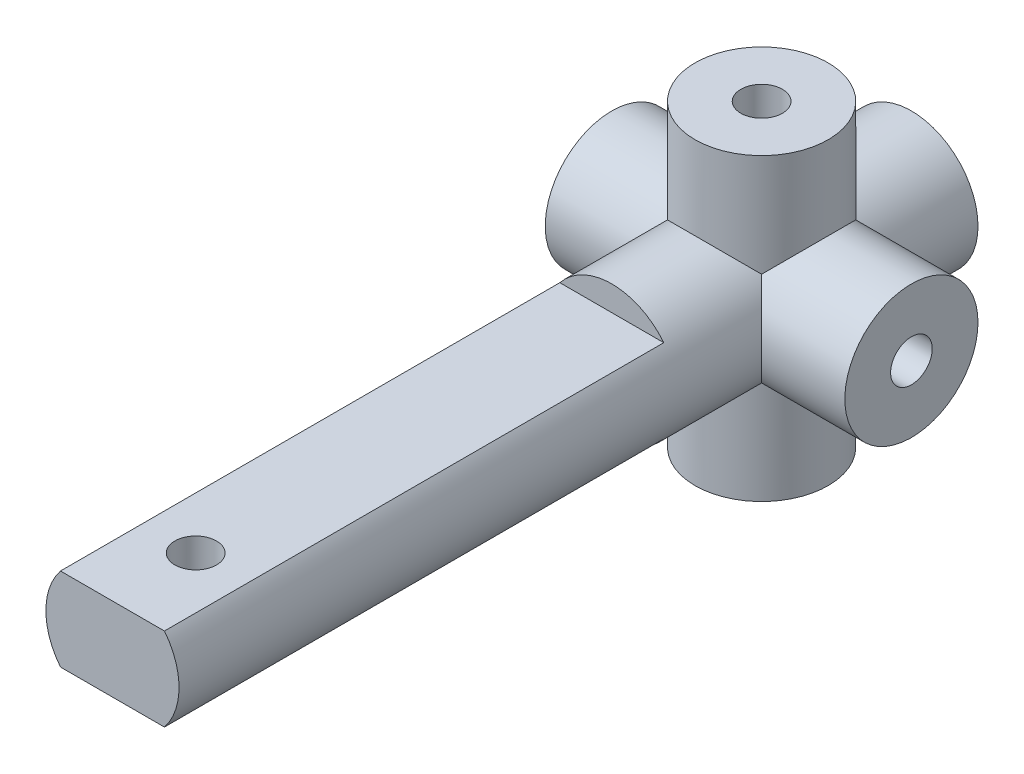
from build123d import *

# Parameters (mm, degrees)
SKETCH1_R           = 4
SKETCH1_R_2         = 1.25
BOSS_EXTRUDE1_DEPTH = 9
SKETCH2_R           = 4
BOSS_EXTRUDE2_DEPTH = 9
SKETCH5_R           = 4
BOSS_EXTRUDE3_DEPTH = 9
SKETCH6_R           = 1.25
CUT_EXTRUDE1_DEPTH  = 18
SKETCH7_R           = 1.25
CUT_EXTRUDE2_DEPTH  = 18
SKETCH8_R           = 1.25
CUT_EXTRUDE3_DEPTH  = 21
BOSS_EXTRUDE4_START = 30
SKETCH9_R           = 4
BOSS_EXTRUDE4_DEPTH = 30
SKETCH10_R          = 1.25
CUT_EXTRUDE4_DEPTH  = 30
CUT_EXTRUDE5_DEPTH  = 30


with BuildPart() as part:
    # Sketch1 → Boss-Extrude1 (new, symmetric)
    with BuildSketch(Plane(origin=(0, 0, 0), x_dir=(1, 0, 0), z_dir=(0, 1, 0))):
        with Locations(Location((0, 0, 0), (0, 0, 270))):
            Circle(SKETCH1_R)
        with Locations(Location((0, 0, 0), (0, 0, 270))):
            Circle(SKETCH1_R_2, mode=Mode.SUBTRACT)
    extrude(amount=BOSS_EXTRUDE1_DEPTH, both=True)

    # Sketch2 → Boss-Extrude2 (add, symmetric)
    with BuildSketch(Plane(origin=(0, 0, 0), x_dir=(0, 0, -1), z_dir=(1, 0, 0))):
        Circle(SKETCH2_R)
    extrude(amount=BOSS_EXTRUDE2_DEPTH, both=True)

    # Sketch5 → Boss-Extrude3 (add, symmetric)
    with BuildSketch(Plane.XY):
        with Locations(Location((0, 0, 0), (0, 0, 135))):
            Circle(SKETCH5_R)
    extrude(amount=BOSS_EXTRUDE3_DEPTH, both=True)

    # Sketch6 → Cut-Extrude1 (cut)
    with BuildSketch(Plane.ZY.offset(9)):
        Circle(SKETCH6_R)
    extrude(amount=-CUT_EXTRUDE1_DEPTH, mode=Mode.SUBTRACT)

    # Sketch7 → Cut-Extrude2 (cut)
    with BuildSketch(Plane.XY.offset(9)):
        Circle(SKETCH7_R)
    extrude(amount=-CUT_EXTRUDE2_DEPTH, mode=Mode.SUBTRACT)

    # Sketch8 → Cut-Extrude3 (cut)
    with BuildSketch(Plane.XZ.offset(9)):
        with Locations(Location((0, 0, 0), (0, 0, 315))):
            Circle(SKETCH8_R)
    extrude(amount=-CUT_EXTRUDE3_DEPTH, mode=Mode.SUBTRACT)

    # Sketch9 → Boss-Extrude4 (add)
    with BuildSketch(Plane.XY.offset(9).offset(BOSS_EXTRUDE4_START)):
        with Locations(Location((0, 0, 0), (0, 0, 135))):
            Circle(SKETCH9_R)
    extrude(amount=-BOSS_EXTRUDE4_DEPTH)

    # Sketch10 → Cut-Extrude4 (cut)
    with BuildSketch(Plane.XZ.offset(9)):
        with Locations(Location((0, 34.0005724, 0), (0, 0, 270))):
            Circle(SKETCH10_R)
    extrude(amount=-CUT_EXTRUDE4_DEPTH, mode=Mode.SUBTRACT)

    # Sketch11 → Cut-Extrude5 (cut)
    with BuildSketch(Plane.XY.offset(39)):
        with BuildLine():
            Line((3.122498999, -2.5), (-3.122498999, -2.5))
            ThreePointArc((-3.122498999, -2.5), (0, -4), (3.122498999, -2.5))
        make_face()
        with BuildLine():
            ThreePointArc((3.122498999, 2.5), (0, 4), (-3.122498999, 2.5))
            Line((-3.122498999, 2.5), (3.122498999, 2.5))
        make_face()
    extrude(amount=-CUT_EXTRUDE5_DEPTH, mode=Mode.SUBTRACT)


solid = part.part
